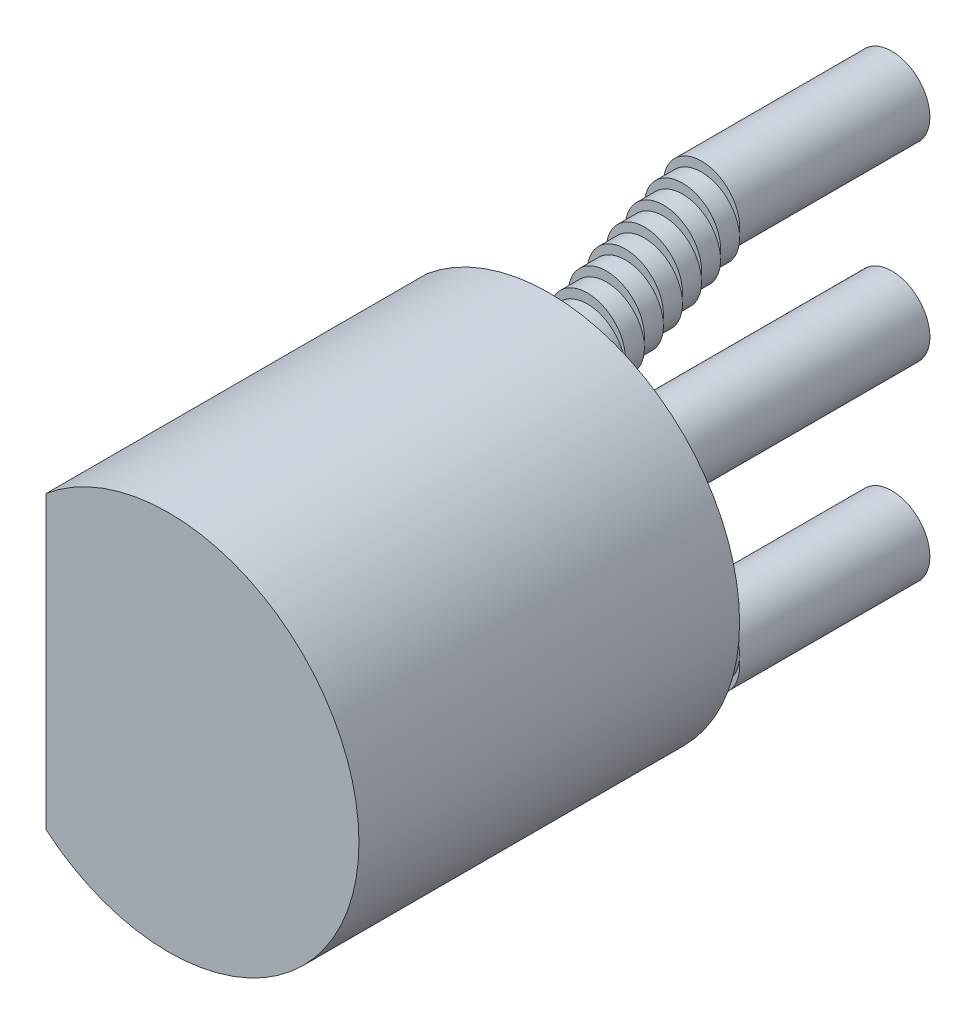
ISO-10303-21;
HEADER;
FILE_DESCRIPTION(('STEP AP214'),'2;1');
FILE_NAME('part.step','',(''),(''),'','','');
FILE_SCHEMA(('AUTOMOTIVE_DESIGN { 1 0 10303 214 1 1 1 1 }'));
ENDSEC;
DATA;
#1=APPLICATION_CONTEXT('core data for automotive mechanical design processes');
#2=APPLICATION_PROTOCOL_DEFINITION('international standard','automotive_design',2000,#1);
#3=PRODUCT_CONTEXT('',#1,'mechanical');
#4=PRODUCT('Part','Part','',(#3));
#5=PRODUCT_RELATED_PRODUCT_CATEGORY('part','',(#4));
#6=PRODUCT_DEFINITION_FORMATION('','',#4);
#7=PRODUCT_DEFINITION_CONTEXT('part definition',#1,'design');
#8=PRODUCT_DEFINITION('design','',#6,#7);
#9=PRODUCT_DEFINITION_SHAPE('','',#8);
#10=(LENGTH_UNIT() NAMED_UNIT(*) SI_UNIT(.MILLI.,.METRE.));
#11=(NAMED_UNIT(*) PLANE_ANGLE_UNIT() SI_UNIT($,.RADIAN.));
#12=(NAMED_UNIT(*) SI_UNIT($,.STERADIAN.) SOLID_ANGLE_UNIT());
#13=UNCERTAINTY_MEASURE_WITH_UNIT(LENGTH_MEASURE(1.E-05),#10,'distance_accuracy_value','');
#14=(GEOMETRIC_REPRESENTATION_CONTEXT(3) GLOBAL_UNCERTAINTY_ASSIGNED_CONTEXT((#13)) GLOBAL_UNIT_ASSIGNED_CONTEXT((#10,
#11,#12)) REPRESENTATION_CONTEXT('',''));
#15=CARTESIAN_POINT('',(0.,0.,0.));
#16=DIRECTION('',(0.,0.,1.));
#17=DIRECTION('',(1.,0.,0.));
#18=AXIS2_PLACEMENT_3D('',#15,#16,#17);
#19=CARTESIAN_POINT('',(0.,0.,0.));
#20=DIRECTION('',(0.,0.,-1.));
#21=DIRECTION('',(-1.,0.,0.));
#22=AXIS2_PLACEMENT_3D('',#19,#20,#21);
#23=PLANE('',#22);
#24=CARTESIAN_POINT('',(0.,1.524,0.));
#25=DIRECTION('',(0.,0.,-1.));
#26=DIRECTION('',(-1.,0.,0.));
#27=AXIS2_PLACEMENT_3D('',#24,#25,#26);
#28=CIRCLE('',#27,0.508);
#29=CARTESIAN_POINT('',(-0.508,1.524,0.));
#30=VERTEX_POINT('',#29);
#31=EDGE_CURVE('E294',#30,#30,#28,.T.);
#32=ORIENTED_EDGE('',*,*,#31,.F.);
#33=EDGE_LOOP('',(#32));
#34=FACE_BOUND('',#33,.T.);
#35=CARTESIAN_POINT('',(0.,0.,0.));
#36=DIRECTION('',(0.,0.,1.));
#37=DIRECTION('',(-1.,0.,0.));
#38=AXIS2_PLACEMENT_3D('',#35,#36,#37);
#39=CIRCLE('',#38,2.54);
#40=CARTESIAN_POINT('',(-1.63544965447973,-1.94342595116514,0.));
#41=VERTEX_POINT('',#40);
#42=CARTESIAN_POINT('',(-1.63544965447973,1.94342595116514,0.));
#43=VERTEX_POINT('',#42);
#44=EDGE_CURVE('E308',#41,#43,#39,.T.);
#45=ORIENTED_EDGE('',*,*,#44,.F.);
#46=DIRECTION('',(0.,-1.,0.));
#47=VECTOR('',#46,1.);
#48=CARTESIAN_POINT('',(-1.63544965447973,1.94342595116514,0.));
#49=LINE('',#48,#47);
#50=EDGE_CURVE('E315',#43,#41,#49,.T.);
#51=ORIENTED_EDGE('',*,*,#50,.F.);
#52=EDGE_LOOP('',(#45,#51));
#53=FACE_BOUND('',#52,.T.);
#54=CARTESIAN_POINT('',(0.,0.,0.));
#55=DIRECTION('',(0.,0.,-1.));
#56=DIRECTION('',(-1.,0.,0.));
#57=AXIS2_PLACEMENT_3D('',#54,#55,#56);
#58=CIRCLE('',#57,0.508);
#59=CARTESIAN_POINT('',(-0.508,0.,0.));
#60=VERTEX_POINT('',#59);
#61=EDGE_CURVE('E301',#60,#60,#58,.T.);
#62=ORIENTED_EDGE('',*,*,#61,.F.);
#63=EDGE_LOOP('',(#62));
#64=FACE_BOUND('',#63,.T.);
#65=CARTESIAN_POINT('',(0.,-1.524,0.));
#66=DIRECTION('',(0.,0.,-1.));
#67=DIRECTION('',(-1.,0.,0.));
#68=AXIS2_PLACEMENT_3D('',#65,#66,#67);
#69=CIRCLE('',#68,0.508);
#70=CARTESIAN_POINT('',(-0.508,-1.524,0.));
#71=VERTEX_POINT('',#70);
#72=EDGE_CURVE('E286',#71,#71,#69,.T.);
#73=ORIENTED_EDGE('',*,*,#72,.F.);
#74=EDGE_LOOP('',(#73));
#75=FACE_BOUND('',#74,.T.);
#76=ADVANCED_FACE('F33',(#34,#53,#64,#75),#23,.T.);
#77=CARTESIAN_POINT('',(0.,0.,5.08));
#78=DIRECTION('',(0.,0.,-1.));
#79=DIRECTION('',(-1.,0.,0.));
#80=AXIS2_PLACEMENT_3D('',#77,#78,#79);
#81=CYLINDRICAL_SURFACE('',#80,2.54);
#82=ORIENTED_EDGE('',*,*,#44,.T.);
#83=DIRECTION('',(0.,0.,-1.));
#84=VECTOR('',#83,1.);
#85=CARTESIAN_POINT('',(-1.63544965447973,1.94342595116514,5.08));
#86=LINE('',#85,#84);
#87=CARTESIAN_POINT('',(-1.63544965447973,1.94342595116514,5.08));
#88=VERTEX_POINT('',#87);
#89=EDGE_CURVE('E11',#88,#43,#86,.T.);
#90=ORIENTED_EDGE('',*,*,#89,.F.);
#91=CARTESIAN_POINT('',(0.,0.,5.08));
#92=DIRECTION('',(0.,0.,1.));
#93=DIRECTION('',(-1.,0.,0.));
#94=AXIS2_PLACEMENT_3D('',#91,#92,#93);
#95=CIRCLE('',#94,2.54);
#96=CARTESIAN_POINT('',(-1.63544965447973,-1.94342595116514,5.08));
#97=VERTEX_POINT('',#96);
#98=EDGE_CURVE('E311',#97,#88,#95,.T.);
#99=ORIENTED_EDGE('',*,*,#98,.F.);
#100=DIRECTION('',(0.,0.,-1.));
#101=VECTOR('',#100,1.);
#102=CARTESIAN_POINT('',(-1.63544965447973,-1.94342595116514,5.08));
#103=LINE('',#102,#101);
#104=EDGE_CURVE('E41',#97,#41,#103,.T.);
#105=ORIENTED_EDGE('',*,*,#104,.T.);
#106=EDGE_LOOP('',(#82,#90,#99,#105));
#107=FACE_BOUND('',#106,.T.);
#108=ADVANCED_FACE('F35',(#107),#81,.T.);
#109=CARTESIAN_POINT('',(-1.63544965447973,1.94342595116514,5.08));
#110=DIRECTION('',(1.,0.,0.));
#111=DIRECTION('',(0.,0.,-1.));
#112=AXIS2_PLACEMENT_3D('',#109,#110,#111);
#113=PLANE('',#112);
#114=ORIENTED_EDGE('',*,*,#50,.T.);
#115=ORIENTED_EDGE('',*,*,#104,.F.);
#116=DIRECTION('',(0.,-1.,0.));
#117=VECTOR('',#116,1.);
#118=CARTESIAN_POINT('',(-1.63544965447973,1.94342595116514,5.08));
#119=LINE('',#118,#117);
#120=EDGE_CURVE('E314',#88,#97,#119,.T.);
#121=ORIENTED_EDGE('',*,*,#120,.F.);
#122=ORIENTED_EDGE('',*,*,#89,.T.);
#123=EDGE_LOOP('',(#114,#115,#121,#122));
#124=FACE_BOUND('',#123,.T.);
#125=ADVANCED_FACE('F328',(#124),#113,.F.);
#126=CARTESIAN_POINT('',(0.,0.,5.08));
#127=DIRECTION('',(0.,0.,-1.));
#128=DIRECTION('',(-1.,0.,0.));
#129=AXIS2_PLACEMENT_3D('',#126,#127,#128);
#130=PLANE('',#129);
#131=ORIENTED_EDGE('',*,*,#98,.T.);
#132=ORIENTED_EDGE('',*,*,#120,.T.);
#133=EDGE_LOOP('',(#131,#132));
#134=FACE_BOUND('',#133,.T.);
#135=ADVANCED_FACE('F330',(#134),#130,.F.);
#136=CARTESIAN_POINT('',(0.,0.,-4.572));
#137=DIRECTION('',(0.,0.,1.));
#138=DIRECTION('',(1.,0.,0.));
#139=AXIS2_PLACEMENT_3D('',#136,#137,#138);
#140=CYLINDRICAL_SURFACE('',#139,0.508);
#141=CARTESIAN_POINT('',(0.,0.,-4.572));
#142=DIRECTION('',(0.,0.,-1.));
#143=DIRECTION('',(-1.,0.,0.));
#144=AXIS2_PLACEMENT_3D('',#141,#142,#143);
#145=CIRCLE('',#144,0.508);
#146=CARTESIAN_POINT('',(-0.508,0.,-4.572));
#147=VERTEX_POINT('',#146);
#148=EDGE_CURVE('E305',#147,#147,#145,.T.);
#149=ORIENTED_EDGE('',*,*,#148,.F.);
#150=EDGE_LOOP('',(#149));
#151=FACE_BOUND('',#150,.T.);
#152=ORIENTED_EDGE('',*,*,#61,.T.);
#153=EDGE_LOOP('',(#152));
#154=FACE_BOUND('',#153,.T.);
#155=ADVANCED_FACE('F332',(#151,#154),#140,.T.);
#156=CARTESIAN_POINT('',(0.,0.,-4.572));
#157=DIRECTION('',(0.,0.,-1.));
#158=DIRECTION('',(-1.,0.,0.));
#159=AXIS2_PLACEMENT_3D('',#156,#157,#158);
#160=PLANE('',#159);
#161=ORIENTED_EDGE('',*,*,#148,.T.);
#162=EDGE_LOOP('',(#161));
#163=FACE_BOUND('',#162,.T.);
#164=ADVANCED_FACE('F338',(#163),#160,.T.);
#165=CARTESIAN_POINT('',(0.,1.524,-0.254));
#166=DIRECTION('',(0.,0.,1.));
#167=DIRECTION('',(1.,0.,0.));
#168=AXIS2_PLACEMENT_3D('',#165,#166,#167);
#169=CYLINDRICAL_SURFACE('',#168,0.508);
#170=CARTESIAN_POINT('',(0.,1.524,-0.254));
#171=DIRECTION('',(0.,0.,-1.));
#172=DIRECTION('',(-1.,0.,0.));
#173=AXIS2_PLACEMENT_3D('',#170,#171,#172);
#174=CIRCLE('',#173,0.508);
#175=CARTESIAN_POINT('',(-0.504015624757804,1.5875,-0.254));
#176=VERTEX_POINT('',#175);
#177=CARTESIAN_POINT('',(0.504015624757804,1.5875,-0.254));
#178=VERTEX_POINT('',#177);
#179=EDGE_CURVE('E298',#176,#178,#174,.T.);
#180=ORIENTED_EDGE('',*,*,#179,.F.);
#181=EDGE_CURVE('E302',#178,#176,#174,.T.);
#182=ORIENTED_EDGE('',*,*,#181,.F.);
#183=EDGE_LOOP('',(#180,#182));
#184=FACE_BOUND('',#183,.T.);
#185=ORIENTED_EDGE('',*,*,#31,.T.);
#186=EDGE_LOOP('',(#185));
#187=FACE_BOUND('',#186,.T.);
#188=ADVANCED_FACE('F349',(#184,#187),#169,.T.);
#189=CARTESIAN_POINT('',(0.,1.524,-0.254));
#190=DIRECTION('',(0.,0.,-1.));
#191=DIRECTION('',(-1.,0.,0.));
#192=AXIS2_PLACEMENT_3D('',#189,#190,#191);
#193=PLANE('',#192);
#194=CARTESIAN_POINT('',(0.,1.651,-0.254));
#195=DIRECTION('',(0.,0.,-1.));
#196=DIRECTION('',(-1.,0.,0.));
#197=AXIS2_PLACEMENT_3D('',#194,#195,#196);
#198=CIRCLE('',#197,0.508);
#199=EDGE_CURVE('E288',#178,#176,#198,.T.);
#200=ORIENTED_EDGE('',*,*,#199,.F.);
#201=ORIENTED_EDGE('',*,*,#181,.T.);
#202=EDGE_LOOP('',(#200,#201));
#203=FACE_BOUND('',#202,.T.);
#204=ADVANCED_FACE('F351',(#203),#193,.T.);
#205=CARTESIAN_POINT('',(0.,-1.524,-0.254));
#206=DIRECTION('',(0.,0.,1.));
#207=DIRECTION('',(1.,0.,0.));
#208=AXIS2_PLACEMENT_3D('',#205,#206,#207);
#209=CYLINDRICAL_SURFACE('',#208,0.508);
#210=CARTESIAN_POINT('',(0.,-1.524,-0.254));
#211=DIRECTION('',(0.,0.,-1.));
#212=DIRECTION('',(-1.,0.,0.));
#213=AXIS2_PLACEMENT_3D('',#210,#211,#212);
#214=CIRCLE('',#213,0.508);
#215=CARTESIAN_POINT('',(0.504015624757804,-1.5875,-0.254));
#216=VERTEX_POINT('',#215);
#217=CARTESIAN_POINT('',(-0.504015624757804,-1.5875,-0.254));
#218=VERTEX_POINT('',#217);
#219=EDGE_CURVE('E291',#216,#218,#214,.T.);
#220=ORIENTED_EDGE('',*,*,#219,.F.);
#221=EDGE_CURVE('E295',#218,#216,#214,.T.);
#222=ORIENTED_EDGE('',*,*,#221,.F.);
#223=EDGE_LOOP('',(#220,#222));
#224=FACE_BOUND('',#223,.T.);
#225=ORIENTED_EDGE('',*,*,#72,.T.);
#226=EDGE_LOOP('',(#225));
#227=FACE_BOUND('',#226,.T.);
#228=ADVANCED_FACE('F358',(#224,#227),#209,.T.);
#229=CARTESIAN_POINT('',(0.,-1.524,-0.254));
#230=DIRECTION('',(0.,0.,-1.));
#231=DIRECTION('',(-1.,0.,0.));
#232=AXIS2_PLACEMENT_3D('',#229,#230,#231);
#233=PLANE('',#232);
#234=CARTESIAN_POINT('',(0.,-1.651,-0.254));
#235=DIRECTION('',(0.,0.,-1.));
#236=DIRECTION('',(-1.,0.,0.));
#237=AXIS2_PLACEMENT_3D('',#234,#235,#236);
#238=CIRCLE('',#237,0.508);
#239=EDGE_CURVE('E280',#218,#216,#238,.T.);
#240=ORIENTED_EDGE('',*,*,#239,.F.);
#241=ORIENTED_EDGE('',*,*,#221,.T.);
#242=EDGE_LOOP('',(#240,#241));
#243=FACE_BOUND('',#242,.T.);
#244=ADVANCED_FACE('F366',(#243),#233,.T.);
#245=CARTESIAN_POINT('',(0.,1.651,-0.254));
#246=DIRECTION('',(0.,0.,-1.));
#247=DIRECTION('',(-1.,0.,0.));
#248=AXIS2_PLACEMENT_3D('',#245,#246,#247);
#249=PLANE('',#248);
#250=EDGE_CURVE('E278',#176,#178,#198,.T.);
#251=ORIENTED_EDGE('',*,*,#250,.F.);
#252=ORIENTED_EDGE('',*,*,#179,.T.);
#253=EDGE_LOOP('',(#251,#252));
#254=FACE_BOUND('',#253,.T.);
#255=ADVANCED_FACE('F370',(#254),#249,.F.);
#256=CARTESIAN_POINT('',(0.,1.651,-0.508));
#257=DIRECTION('',(0.,0.,1.));
#258=DIRECTION('',(1.,0.,0.));
#259=AXIS2_PLACEMENT_3D('',#256,#257,#258);
#260=CYLINDRICAL_SURFACE('',#259,0.508);
#261=CARTESIAN_POINT('',(0.,1.651,-0.508));
#262=DIRECTION('',(0.,0.,-1.));
#263=DIRECTION('',(-1.,0.,0.));
#264=AXIS2_PLACEMENT_3D('',#261,#262,#263);
#265=CIRCLE('',#264,0.508);
#266=CARTESIAN_POINT('',(-0.504015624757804,1.7145,-0.508));
#267=VERTEX_POINT('',#266);
#268=CARTESIAN_POINT('',(0.504015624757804,1.7145,-0.508));
#269=VERTEX_POINT('',#268);
#270=EDGE_CURVE('E283',#267,#269,#265,.T.);
#271=ORIENTED_EDGE('',*,*,#270,.F.);
#272=EDGE_CURVE('E287',#269,#267,#265,.T.);
#273=ORIENTED_EDGE('',*,*,#272,.F.);
#274=EDGE_LOOP('',(#271,#273));
#275=FACE_BOUND('',#274,.T.);
#276=ORIENTED_EDGE('',*,*,#199,.T.);
#277=ORIENTED_EDGE('',*,*,#250,.T.);
#278=EDGE_LOOP('',(#276,#277));
#279=FACE_BOUND('',#278,.T.);
#280=ADVANCED_FACE('F372',(#275,#279),#260,.T.);
#281=CARTESIAN_POINT('',(0.,1.651,-0.508));
#282=DIRECTION('',(0.,0.,-1.));
#283=DIRECTION('',(-1.,0.,0.));
#284=AXIS2_PLACEMENT_3D('',#281,#282,#283);
#285=PLANE('',#284);
#286=CARTESIAN_POINT('',(0.,1.778,-0.508));
#287=DIRECTION('',(0.,0.,-1.));
#288=DIRECTION('',(-1.,0.,0.));
#289=AXIS2_PLACEMENT_3D('',#286,#287,#288);
#290=CIRCLE('',#289,0.508);
#291=EDGE_CURVE('E272',#269,#267,#290,.T.);
#292=ORIENTED_EDGE('',*,*,#291,.F.);
#293=ORIENTED_EDGE('',*,*,#272,.T.);
#294=EDGE_LOOP('',(#292,#293));
#295=FACE_BOUND('',#294,.T.);
#296=ADVANCED_FACE('F375',(#295),#285,.T.);
#297=CARTESIAN_POINT('',(0.,-1.651,-0.254));
#298=DIRECTION('',(0.,0.,-1.));
#299=DIRECTION('',(-1.,0.,0.));
#300=AXIS2_PLACEMENT_3D('',#297,#298,#299);
#301=PLANE('',#300);
#302=EDGE_CURVE('E270',#216,#218,#238,.T.);
#303=ORIENTED_EDGE('',*,*,#302,.F.);
#304=ORIENTED_EDGE('',*,*,#219,.T.);
#305=EDGE_LOOP('',(#303,#304));
#306=FACE_BOUND('',#305,.T.);
#307=ADVANCED_FACE('F382',(#306),#301,.F.);
#308=CARTESIAN_POINT('',(0.,-1.651,-0.508));
#309=DIRECTION('',(0.,0.,1.));
#310=DIRECTION('',(1.,0.,0.));
#311=AXIS2_PLACEMENT_3D('',#308,#309,#310);
#312=CYLINDRICAL_SURFACE('',#311,0.508);
#313=CARTESIAN_POINT('',(0.,-1.651,-0.508));
#314=DIRECTION('',(0.,0.,-1.));
#315=DIRECTION('',(-1.,0.,0.));
#316=AXIS2_PLACEMENT_3D('',#313,#314,#315);
#317=CIRCLE('',#316,0.508);
#318=CARTESIAN_POINT('',(0.504015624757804,-1.7145,-0.508));
#319=VERTEX_POINT('',#318);
#320=CARTESIAN_POINT('',(-0.504015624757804,-1.7145,-0.508));
#321=VERTEX_POINT('',#320);
#322=EDGE_CURVE('E275',#319,#321,#317,.T.);
#323=ORIENTED_EDGE('',*,*,#322,.F.);
#324=EDGE_CURVE('E279',#321,#319,#317,.T.);
#325=ORIENTED_EDGE('',*,*,#324,.F.);
#326=EDGE_LOOP('',(#323,#325));
#327=FACE_BOUND('',#326,.T.);
#328=ORIENTED_EDGE('',*,*,#239,.T.);
#329=ORIENTED_EDGE('',*,*,#302,.T.);
#330=EDGE_LOOP('',(#328,#329));
#331=FACE_BOUND('',#330,.T.);
#332=ADVANCED_FACE('F384',(#327,#331),#312,.T.);
#333=CARTESIAN_POINT('',(0.,-1.651,-0.508));
#334=DIRECTION('',(0.,0.,-1.));
#335=DIRECTION('',(-1.,0.,0.));
#336=AXIS2_PLACEMENT_3D('',#333,#334,#335);
#337=PLANE('',#336);
#338=CARTESIAN_POINT('',(0.,-1.778,-0.508));
#339=DIRECTION('',(0.,0.,-1.));
#340=DIRECTION('',(-1.,0.,0.));
#341=AXIS2_PLACEMENT_3D('',#338,#339,#340);
#342=CIRCLE('',#341,0.508);
#343=EDGE_CURVE('E264',#321,#319,#342,.T.);
#344=ORIENTED_EDGE('',*,*,#343,.F.);
#345=ORIENTED_EDGE('',*,*,#324,.T.);
#346=EDGE_LOOP('',(#344,#345));
#347=FACE_BOUND('',#346,.T.);
#348=ADVANCED_FACE('F387',(#347),#337,.T.);
#349=CARTESIAN_POINT('',(0.,1.778,-0.508));
#350=DIRECTION('',(0.,0.,-1.));
#351=DIRECTION('',(-1.,0.,0.));
#352=AXIS2_PLACEMENT_3D('',#349,#350,#351);
#353=PLANE('',#352);
#354=EDGE_CURVE('E262',#267,#269,#290,.T.);
#355=ORIENTED_EDGE('',*,*,#354,.F.);
#356=ORIENTED_EDGE('',*,*,#270,.T.);
#357=EDGE_LOOP('',(#355,#356));
#358=FACE_BOUND('',#357,.T.);
#359=ADVANCED_FACE('F394',(#358),#353,.F.);
#360=CARTESIAN_POINT('',(0.,1.778,-0.762));
#361=DIRECTION('',(0.,0.,1.));
#362=DIRECTION('',(1.,0.,0.));
#363=AXIS2_PLACEMENT_3D('',#360,#361,#362);
#364=CYLINDRICAL_SURFACE('',#363,0.508);
#365=CARTESIAN_POINT('',(0.,1.778,-0.762));
#366=DIRECTION('',(0.,0.,-1.));
#367=DIRECTION('',(-1.,0.,0.));
#368=AXIS2_PLACEMENT_3D('',#365,#366,#367);
#369=CIRCLE('',#368,0.508);
#370=CARTESIAN_POINT('',(-0.504015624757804,1.8415,-0.762));
#371=VERTEX_POINT('',#370);
#372=CARTESIAN_POINT('',(0.504015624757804,1.8415,-0.762));
#373=VERTEX_POINT('',#372);
#374=EDGE_CURVE('E267',#371,#373,#369,.T.);
#375=ORIENTED_EDGE('',*,*,#374,.F.);
#376=EDGE_CURVE('E271',#373,#371,#369,.T.);
#377=ORIENTED_EDGE('',*,*,#376,.F.);
#378=EDGE_LOOP('',(#375,#377));
#379=FACE_BOUND('',#378,.T.);
#380=ORIENTED_EDGE('',*,*,#291,.T.);
#381=ORIENTED_EDGE('',*,*,#354,.T.);
#382=EDGE_LOOP('',(#380,#381));
#383=FACE_BOUND('',#382,.T.);
#384=ADVANCED_FACE('F396',(#379,#383),#364,.T.);
#385=CARTESIAN_POINT('',(0.,1.778,-0.762));
#386=DIRECTION('',(0.,0.,-1.));
#387=DIRECTION('',(-1.,0.,0.));
#388=AXIS2_PLACEMENT_3D('',#385,#386,#387);
#389=PLANE('',#388);
#390=CARTESIAN_POINT('',(0.,1.905,-0.762));
#391=DIRECTION('',(0.,0.,-1.));
#392=DIRECTION('',(-1.,0.,0.));
#393=AXIS2_PLACEMENT_3D('',#390,#391,#392);
#394=CIRCLE('',#393,0.508);
#395=EDGE_CURVE('E256',#373,#371,#394,.T.);
#396=ORIENTED_EDGE('',*,*,#395,.F.);
#397=ORIENTED_EDGE('',*,*,#376,.T.);
#398=EDGE_LOOP('',(#396,#397));
#399=FACE_BOUND('',#398,.T.);
#400=ADVANCED_FACE('F399',(#399),#389,.T.);
#401=CARTESIAN_POINT('',(0.,-1.778,-0.508));
#402=DIRECTION('',(0.,0.,-1.));
#403=DIRECTION('',(-1.,0.,0.));
#404=AXIS2_PLACEMENT_3D('',#401,#402,#403);
#405=PLANE('',#404);
#406=EDGE_CURVE('E254',#319,#321,#342,.T.);
#407=ORIENTED_EDGE('',*,*,#406,.F.);
#408=ORIENTED_EDGE('',*,*,#322,.T.);
#409=EDGE_LOOP('',(#407,#408));
#410=FACE_BOUND('',#409,.T.);
#411=ADVANCED_FACE('F406',(#410),#405,.F.);
#412=CARTESIAN_POINT('',(0.,-1.778,-0.762));
#413=DIRECTION('',(0.,0.,1.));
#414=DIRECTION('',(1.,0.,0.));
#415=AXIS2_PLACEMENT_3D('',#412,#413,#414);
#416=CYLINDRICAL_SURFACE('',#415,0.508);
#417=CARTESIAN_POINT('',(0.,-1.778,-0.762));
#418=DIRECTION('',(0.,0.,-1.));
#419=DIRECTION('',(-1.,0.,0.));
#420=AXIS2_PLACEMENT_3D('',#417,#418,#419);
#421=CIRCLE('',#420,0.508);
#422=CARTESIAN_POINT('',(0.504015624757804,-1.8415,-0.762));
#423=VERTEX_POINT('',#422);
#424=CARTESIAN_POINT('',(-0.504015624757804,-1.8415,-0.762));
#425=VERTEX_POINT('',#424);
#426=EDGE_CURVE('E259',#423,#425,#421,.T.);
#427=ORIENTED_EDGE('',*,*,#426,.F.);
#428=EDGE_CURVE('E263',#425,#423,#421,.T.);
#429=ORIENTED_EDGE('',*,*,#428,.F.);
#430=EDGE_LOOP('',(#427,#429));
#431=FACE_BOUND('',#430,.T.);
#432=ORIENTED_EDGE('',*,*,#343,.T.);
#433=ORIENTED_EDGE('',*,*,#406,.T.);
#434=EDGE_LOOP('',(#432,#433));
#435=FACE_BOUND('',#434,.T.);
#436=ADVANCED_FACE('F408',(#431,#435),#416,.T.);
#437=CARTESIAN_POINT('',(0.,-1.778,-0.762));
#438=DIRECTION('',(0.,0.,-1.));
#439=DIRECTION('',(-1.,0.,0.));
#440=AXIS2_PLACEMENT_3D('',#437,#438,#439);
#441=PLANE('',#440);
#442=CARTESIAN_POINT('',(0.,-1.905,-0.762));
#443=DIRECTION('',(0.,0.,-1.));
#444=DIRECTION('',(-1.,0.,0.));
#445=AXIS2_PLACEMENT_3D('',#442,#443,#444);
#446=CIRCLE('',#445,0.508);
#447=EDGE_CURVE('E248',#425,#423,#446,.T.);
#448=ORIENTED_EDGE('',*,*,#447,.F.);
#449=ORIENTED_EDGE('',*,*,#428,.T.);
#450=EDGE_LOOP('',(#448,#449));
#451=FACE_BOUND('',#450,.T.);
#452=ADVANCED_FACE('F411',(#451),#441,.T.);
#453=CARTESIAN_POINT('',(0.,1.905,-0.762));
#454=DIRECTION('',(0.,0.,-1.));
#455=DIRECTION('',(-1.,0.,0.));
#456=AXIS2_PLACEMENT_3D('',#453,#454,#455);
#457=PLANE('',#456);
#458=EDGE_CURVE('E246',#371,#373,#394,.T.);
#459=ORIENTED_EDGE('',*,*,#458,.F.);
#460=ORIENTED_EDGE('',*,*,#374,.T.);
#461=EDGE_LOOP('',(#459,#460));
#462=FACE_BOUND('',#461,.T.);
#463=ADVANCED_FACE('F418',(#462),#457,.F.);
#464=CARTESIAN_POINT('',(0.,1.905,-1.016));
#465=DIRECTION('',(0.,0.,1.));
#466=DIRECTION('',(1.,0.,0.));
#467=AXIS2_PLACEMENT_3D('',#464,#465,#466);
#468=CYLINDRICAL_SURFACE('',#467,0.508);
#469=CARTESIAN_POINT('',(0.,1.905,-1.016));
#470=DIRECTION('',(0.,0.,-1.));
#471=DIRECTION('',(-1.,0.,0.));
#472=AXIS2_PLACEMENT_3D('',#469,#470,#471);
#473=CIRCLE('',#472,0.508);
#474=CARTESIAN_POINT('',(-0.504015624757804,1.9685,-1.016));
#475=VERTEX_POINT('',#474);
#476=CARTESIAN_POINT('',(0.504015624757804,1.9685,-1.016));
#477=VERTEX_POINT('',#476);
#478=EDGE_CURVE('E251',#475,#477,#473,.T.);
#479=ORIENTED_EDGE('',*,*,#478,.F.);
#480=EDGE_CURVE('E255',#477,#475,#473,.T.);
#481=ORIENTED_EDGE('',*,*,#480,.F.);
#482=EDGE_LOOP('',(#479,#481));
#483=FACE_BOUND('',#482,.T.);
#484=ORIENTED_EDGE('',*,*,#395,.T.);
#485=ORIENTED_EDGE('',*,*,#458,.T.);
#486=EDGE_LOOP('',(#484,#485));
#487=FACE_BOUND('',#486,.T.);
#488=ADVANCED_FACE('F420',(#483,#487),#468,.T.);
#489=CARTESIAN_POINT('',(0.,1.905,-1.016));
#490=DIRECTION('',(0.,0.,-1.));
#491=DIRECTION('',(-1.,0.,0.));
#492=AXIS2_PLACEMENT_3D('',#489,#490,#491);
#493=PLANE('',#492);
#494=CARTESIAN_POINT('',(0.,2.032,-1.016));
#495=DIRECTION('',(0.,0.,-1.));
#496=DIRECTION('',(-1.,0.,0.));
#497=AXIS2_PLACEMENT_3D('',#494,#495,#496);
#498=CIRCLE('',#497,0.508);
#499=EDGE_CURVE('E240',#477,#475,#498,.T.);
#500=ORIENTED_EDGE('',*,*,#499,.F.);
#501=ORIENTED_EDGE('',*,*,#480,.T.);
#502=EDGE_LOOP('',(#500,#501));
#503=FACE_BOUND('',#502,.T.);
#504=ADVANCED_FACE('F423',(#503),#493,.T.);
#505=CARTESIAN_POINT('',(0.,-1.905,-0.762));
#506=DIRECTION('',(0.,0.,-1.));
#507=DIRECTION('',(-1.,0.,0.));
#508=AXIS2_PLACEMENT_3D('',#505,#506,#507);
#509=PLANE('',#508);
#510=EDGE_CURVE('E238',#423,#425,#446,.T.);
#511=ORIENTED_EDGE('',*,*,#510,.F.);
#512=ORIENTED_EDGE('',*,*,#426,.T.);
#513=EDGE_LOOP('',(#511,#512));
#514=FACE_BOUND('',#513,.T.);
#515=ADVANCED_FACE('F430',(#514),#509,.F.);
#516=CARTESIAN_POINT('',(0.,-1.905,-1.016));
#517=DIRECTION('',(0.,0.,1.));
#518=DIRECTION('',(1.,0.,0.));
#519=AXIS2_PLACEMENT_3D('',#516,#517,#518);
#520=CYLINDRICAL_SURFACE('',#519,0.508);
#521=CARTESIAN_POINT('',(0.,-1.905,-1.016));
#522=DIRECTION('',(0.,0.,-1.));
#523=DIRECTION('',(-1.,0.,0.));
#524=AXIS2_PLACEMENT_3D('',#521,#522,#523);
#525=CIRCLE('',#524,0.508);
#526=CARTESIAN_POINT('',(0.504015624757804,-1.9685,-1.016));
#527=VERTEX_POINT('',#526);
#528=CARTESIAN_POINT('',(-0.504015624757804,-1.9685,-1.016));
#529=VERTEX_POINT('',#528);
#530=EDGE_CURVE('E243',#527,#529,#525,.T.);
#531=ORIENTED_EDGE('',*,*,#530,.F.);
#532=EDGE_CURVE('E247',#529,#527,#525,.T.);
#533=ORIENTED_EDGE('',*,*,#532,.F.);
#534=EDGE_LOOP('',(#531,#533));
#535=FACE_BOUND('',#534,.T.);
#536=ORIENTED_EDGE('',*,*,#447,.T.);
#537=ORIENTED_EDGE('',*,*,#510,.T.);
#538=EDGE_LOOP('',(#536,#537));
#539=FACE_BOUND('',#538,.T.);
#540=ADVANCED_FACE('F432',(#535,#539),#520,.T.);
#541=CARTESIAN_POINT('',(0.,-1.905,-1.016));
#542=DIRECTION('',(0.,0.,-1.));
#543=DIRECTION('',(-1.,0.,0.));
#544=AXIS2_PLACEMENT_3D('',#541,#542,#543);
#545=PLANE('',#544);
#546=CARTESIAN_POINT('',(0.,-2.032,-1.016));
#547=DIRECTION('',(0.,0.,-1.));
#548=DIRECTION('',(-1.,0.,0.));
#549=AXIS2_PLACEMENT_3D('',#546,#547,#548);
#550=CIRCLE('',#549,0.508);
#551=EDGE_CURVE('E232',#529,#527,#550,.T.);
#552=ORIENTED_EDGE('',*,*,#551,.F.);
#553=ORIENTED_EDGE('',*,*,#532,.T.);
#554=EDGE_LOOP('',(#552,#553));
#555=FACE_BOUND('',#554,.T.);
#556=ADVANCED_FACE('F435',(#555),#545,.T.);
#557=CARTESIAN_POINT('',(0.,2.032,-1.016));
#558=DIRECTION('',(0.,0.,-1.));
#559=DIRECTION('',(-1.,0.,0.));
#560=AXIS2_PLACEMENT_3D('',#557,#558,#559);
#561=PLANE('',#560);
#562=EDGE_CURVE('E230',#475,#477,#498,.T.);
#563=ORIENTED_EDGE('',*,*,#562,.F.);
#564=ORIENTED_EDGE('',*,*,#478,.T.);
#565=EDGE_LOOP('',(#563,#564));
#566=FACE_BOUND('',#565,.T.);
#567=ADVANCED_FACE('F442',(#566),#561,.F.);
#568=CARTESIAN_POINT('',(0.,2.032,-1.27));
#569=DIRECTION('',(0.,0.,1.));
#570=DIRECTION('',(1.,0.,0.));
#571=AXIS2_PLACEMENT_3D('',#568,#569,#570);
#572=CYLINDRICAL_SURFACE('',#571,0.508);
#573=CARTESIAN_POINT('',(0.,2.032,-1.27));
#574=DIRECTION('',(0.,0.,-1.));
#575=DIRECTION('',(-1.,0.,0.));
#576=AXIS2_PLACEMENT_3D('',#573,#574,#575);
#577=CIRCLE('',#576,0.508);
#578=CARTESIAN_POINT('',(-0.504015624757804,2.0955,-1.27));
#579=VERTEX_POINT('',#578);
#580=CARTESIAN_POINT('',(0.504015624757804,2.0955,-1.27));
#581=VERTEX_POINT('',#580);
#582=EDGE_CURVE('E235',#579,#581,#577,.T.);
#583=ORIENTED_EDGE('',*,*,#582,.F.);
#584=EDGE_CURVE('E239',#581,#579,#577,.T.);
#585=ORIENTED_EDGE('',*,*,#584,.F.);
#586=EDGE_LOOP('',(#583,#585));
#587=FACE_BOUND('',#586,.T.);
#588=ORIENTED_EDGE('',*,*,#499,.T.);
#589=ORIENTED_EDGE('',*,*,#562,.T.);
#590=EDGE_LOOP('',(#588,#589));
#591=FACE_BOUND('',#590,.T.);
#592=ADVANCED_FACE('F444',(#587,#591),#572,.T.);
#593=CARTESIAN_POINT('',(0.,2.032,-1.27));
#594=DIRECTION('',(0.,0.,-1.));
#595=DIRECTION('',(-1.,0.,0.));
#596=AXIS2_PLACEMENT_3D('',#593,#594,#595);
#597=PLANE('',#596);
#598=CARTESIAN_POINT('',(0.,2.159,-1.27));
#599=DIRECTION('',(0.,0.,-1.));
#600=DIRECTION('',(-1.,0.,0.));
#601=AXIS2_PLACEMENT_3D('',#598,#599,#600);
#602=CIRCLE('',#601,0.508);
#603=EDGE_CURVE('E224',#581,#579,#602,.T.);
#604=ORIENTED_EDGE('',*,*,#603,.F.);
#605=ORIENTED_EDGE('',*,*,#584,.T.);
#606=EDGE_LOOP('',(#604,#605));
#607=FACE_BOUND('',#606,.T.);
#608=ADVANCED_FACE('F447',(#607),#597,.T.);
#609=CARTESIAN_POINT('',(0.,-2.032,-1.016));
#610=DIRECTION('',(0.,0.,-1.));
#611=DIRECTION('',(-1.,0.,0.));
#612=AXIS2_PLACEMENT_3D('',#609,#610,#611);
#613=PLANE('',#612);
#614=EDGE_CURVE('E222',#527,#529,#550,.T.);
#615=ORIENTED_EDGE('',*,*,#614,.F.);
#616=ORIENTED_EDGE('',*,*,#530,.T.);
#617=EDGE_LOOP('',(#615,#616));
#618=FACE_BOUND('',#617,.T.);
#619=ADVANCED_FACE('F454',(#618),#613,.F.);
#620=CARTESIAN_POINT('',(0.,-2.032,-1.27));
#621=DIRECTION('',(0.,0.,1.));
#622=DIRECTION('',(1.,0.,0.));
#623=AXIS2_PLACEMENT_3D('',#620,#621,#622);
#624=CYLINDRICAL_SURFACE('',#623,0.508);
#625=CARTESIAN_POINT('',(0.,-2.032,-1.27));
#626=DIRECTION('',(0.,0.,-1.));
#627=DIRECTION('',(-1.,0.,0.));
#628=AXIS2_PLACEMENT_3D('',#625,#626,#627);
#629=CIRCLE('',#628,0.508);
#630=CARTESIAN_POINT('',(0.504015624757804,-2.0955,-1.27));
#631=VERTEX_POINT('',#630);
#632=CARTESIAN_POINT('',(-0.504015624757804,-2.0955,-1.27));
#633=VERTEX_POINT('',#632);
#634=EDGE_CURVE('E227',#631,#633,#629,.T.);
#635=ORIENTED_EDGE('',*,*,#634,.F.);
#636=EDGE_CURVE('E231',#633,#631,#629,.T.);
#637=ORIENTED_EDGE('',*,*,#636,.F.);
#638=EDGE_LOOP('',(#635,#637));
#639=FACE_BOUND('',#638,.T.);
#640=ORIENTED_EDGE('',*,*,#551,.T.);
#641=ORIENTED_EDGE('',*,*,#614,.T.);
#642=EDGE_LOOP('',(#640,#641));
#643=FACE_BOUND('',#642,.T.);
#644=ADVANCED_FACE('F456',(#639,#643),#624,.T.);
#645=CARTESIAN_POINT('',(0.,-2.032,-1.27));
#646=DIRECTION('',(0.,0.,-1.));
#647=DIRECTION('',(-1.,0.,0.));
#648=AXIS2_PLACEMENT_3D('',#645,#646,#647);
#649=PLANE('',#648);
#650=CARTESIAN_POINT('',(0.,-2.159,-1.27));
#651=DIRECTION('',(0.,0.,-1.));
#652=DIRECTION('',(-1.,0.,0.));
#653=AXIS2_PLACEMENT_3D('',#650,#651,#652);
#654=CIRCLE('',#653,0.508);
#655=EDGE_CURVE('E216',#633,#631,#654,.T.);
#656=ORIENTED_EDGE('',*,*,#655,.F.);
#657=ORIENTED_EDGE('',*,*,#636,.T.);
#658=EDGE_LOOP('',(#656,#657));
#659=FACE_BOUND('',#658,.T.);
#660=ADVANCED_FACE('F459',(#659),#649,.T.);
#661=CARTESIAN_POINT('',(0.,2.159,-1.27));
#662=DIRECTION('',(0.,0.,-1.));
#663=DIRECTION('',(-1.,0.,0.));
#664=AXIS2_PLACEMENT_3D('',#661,#662,#663);
#665=PLANE('',#664);
#666=EDGE_CURVE('E214',#579,#581,#602,.T.);
#667=ORIENTED_EDGE('',*,*,#666,.F.);
#668=ORIENTED_EDGE('',*,*,#582,.T.);
#669=EDGE_LOOP('',(#667,#668));
#670=FACE_BOUND('',#669,.T.);
#671=ADVANCED_FACE('F466',(#670),#665,.F.);
#672=CARTESIAN_POINT('',(0.,2.159,-1.524));
#673=DIRECTION('',(0.,0.,1.));
#674=DIRECTION('',(1.,0.,0.));
#675=AXIS2_PLACEMENT_3D('',#672,#673,#674);
#676=CYLINDRICAL_SURFACE('',#675,0.508);
#677=CARTESIAN_POINT('',(0.,2.159,-1.524));
#678=DIRECTION('',(0.,0.,-1.));
#679=DIRECTION('',(-1.,0.,0.));
#680=AXIS2_PLACEMENT_3D('',#677,#678,#679);
#681=CIRCLE('',#680,0.508);
#682=CARTESIAN_POINT('',(-0.504015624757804,2.2225,-1.524));
#683=VERTEX_POINT('',#682);
#684=CARTESIAN_POINT('',(0.504015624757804,2.2225,-1.524));
#685=VERTEX_POINT('',#684);
#686=EDGE_CURVE('E219',#683,#685,#681,.T.);
#687=ORIENTED_EDGE('',*,*,#686,.F.);
#688=EDGE_CURVE('E223',#685,#683,#681,.T.);
#689=ORIENTED_EDGE('',*,*,#688,.F.);
#690=EDGE_LOOP('',(#687,#689));
#691=FACE_BOUND('',#690,.T.);
#692=ORIENTED_EDGE('',*,*,#603,.T.);
#693=ORIENTED_EDGE('',*,*,#666,.T.);
#694=EDGE_LOOP('',(#692,#693));
#695=FACE_BOUND('',#694,.T.);
#696=ADVANCED_FACE('F468',(#691,#695),#676,.T.);
#697=CARTESIAN_POINT('',(0.,2.159,-1.524));
#698=DIRECTION('',(0.,0.,-1.));
#699=DIRECTION('',(-1.,0.,0.));
#700=AXIS2_PLACEMENT_3D('',#697,#698,#699);
#701=PLANE('',#700);
#702=CARTESIAN_POINT('',(0.,2.286,-1.524));
#703=DIRECTION('',(0.,0.,-1.));
#704=DIRECTION('',(-1.,0.,0.));
#705=AXIS2_PLACEMENT_3D('',#702,#703,#704);
#706=CIRCLE('',#705,0.508);
#707=EDGE_CURVE('E208',#685,#683,#706,.T.);
#708=ORIENTED_EDGE('',*,*,#707,.F.);
#709=ORIENTED_EDGE('',*,*,#688,.T.);
#710=EDGE_LOOP('',(#708,#709));
#711=FACE_BOUND('',#710,.T.);
#712=ADVANCED_FACE('F471',(#711),#701,.T.);
#713=CARTESIAN_POINT('',(0.,-2.159,-1.27));
#714=DIRECTION('',(0.,0.,-1.));
#715=DIRECTION('',(-1.,0.,0.));
#716=AXIS2_PLACEMENT_3D('',#713,#714,#715);
#717=PLANE('',#716);
#718=EDGE_CURVE('E206',#631,#633,#654,.T.);
#719=ORIENTED_EDGE('',*,*,#718,.F.);
#720=ORIENTED_EDGE('',*,*,#634,.T.);
#721=EDGE_LOOP('',(#719,#720));
#722=FACE_BOUND('',#721,.T.);
#723=ADVANCED_FACE('F478',(#722),#717,.F.);
#724=CARTESIAN_POINT('',(0.,-2.159,-1.524));
#725=DIRECTION('',(0.,0.,1.));
#726=DIRECTION('',(1.,0.,0.));
#727=AXIS2_PLACEMENT_3D('',#724,#725,#726);
#728=CYLINDRICAL_SURFACE('',#727,0.508);
#729=CARTESIAN_POINT('',(0.,-2.159,-1.524));
#730=DIRECTION('',(0.,0.,-1.));
#731=DIRECTION('',(-1.,0.,0.));
#732=AXIS2_PLACEMENT_3D('',#729,#730,#731);
#733=CIRCLE('',#732,0.508);
#734=CARTESIAN_POINT('',(0.504015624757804,-2.2225,-1.524));
#735=VERTEX_POINT('',#734);
#736=CARTESIAN_POINT('',(-0.504015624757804,-2.2225,-1.524));
#737=VERTEX_POINT('',#736);
#738=EDGE_CURVE('E211',#735,#737,#733,.T.);
#739=ORIENTED_EDGE('',*,*,#738,.F.);
#740=EDGE_CURVE('E215',#737,#735,#733,.T.);
#741=ORIENTED_EDGE('',*,*,#740,.F.);
#742=EDGE_LOOP('',(#739,#741));
#743=FACE_BOUND('',#742,.T.);
#744=ORIENTED_EDGE('',*,*,#655,.T.);
#745=ORIENTED_EDGE('',*,*,#718,.T.);
#746=EDGE_LOOP('',(#744,#745));
#747=FACE_BOUND('',#746,.T.);
#748=ADVANCED_FACE('F480',(#743,#747),#728,.T.);
#749=CARTESIAN_POINT('',(0.,-2.159,-1.524));
#750=DIRECTION('',(0.,0.,-1.));
#751=DIRECTION('',(-1.,0.,0.));
#752=AXIS2_PLACEMENT_3D('',#749,#750,#751);
#753=PLANE('',#752);
#754=CARTESIAN_POINT('',(0.,-2.286,-1.524));
#755=DIRECTION('',(0.,0.,-1.));
#756=DIRECTION('',(-1.,0.,0.));
#757=AXIS2_PLACEMENT_3D('',#754,#755,#756);
#758=CIRCLE('',#757,0.508);
#759=EDGE_CURVE('E200',#737,#735,#758,.T.);
#760=ORIENTED_EDGE('',*,*,#759,.F.);
#761=ORIENTED_EDGE('',*,*,#740,.T.);
#762=EDGE_LOOP('',(#760,#761));
#763=FACE_BOUND('',#762,.T.);
#764=ADVANCED_FACE('F483',(#763),#753,.T.);
#765=CARTESIAN_POINT('',(0.,2.286,-1.524));
#766=DIRECTION('',(0.,0.,-1.));
#767=DIRECTION('',(-1.,0.,0.));
#768=AXIS2_PLACEMENT_3D('',#765,#766,#767);
#769=PLANE('',#768);
#770=EDGE_CURVE('E198',#683,#685,#706,.T.);
#771=ORIENTED_EDGE('',*,*,#770,.F.);
#772=ORIENTED_EDGE('',*,*,#686,.T.);
#773=EDGE_LOOP('',(#771,#772));
#774=FACE_BOUND('',#773,.T.);
#775=ADVANCED_FACE('F490',(#774),#769,.F.);
#776=CARTESIAN_POINT('',(0.,2.286,-1.778));
#777=DIRECTION('',(0.,0.,1.));
#778=DIRECTION('',(1.,0.,0.));
#779=AXIS2_PLACEMENT_3D('',#776,#777,#778);
#780=CYLINDRICAL_SURFACE('',#779,0.508);
#781=CARTESIAN_POINT('',(0.,2.286,-1.778));
#782=DIRECTION('',(0.,0.,-1.));
#783=DIRECTION('',(-1.,0.,0.));
#784=AXIS2_PLACEMENT_3D('',#781,#782,#783);
#785=CIRCLE('',#784,0.508);
#786=CARTESIAN_POINT('',(-0.504015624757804,2.3495,-1.778));
#787=VERTEX_POINT('',#786);
#788=CARTESIAN_POINT('',(0.504015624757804,2.3495,-1.778));
#789=VERTEX_POINT('',#788);
#790=EDGE_CURVE('E203',#787,#789,#785,.T.);
#791=ORIENTED_EDGE('',*,*,#790,.F.);
#792=EDGE_CURVE('E207',#789,#787,#785,.T.);
#793=ORIENTED_EDGE('',*,*,#792,.F.);
#794=EDGE_LOOP('',(#791,#793));
#795=FACE_BOUND('',#794,.T.);
#796=ORIENTED_EDGE('',*,*,#707,.T.);
#797=ORIENTED_EDGE('',*,*,#770,.T.);
#798=EDGE_LOOP('',(#796,#797));
#799=FACE_BOUND('',#798,.T.);
#800=ADVANCED_FACE('F492',(#795,#799),#780,.T.);
#801=CARTESIAN_POINT('',(0.,2.286,-1.778));
#802=DIRECTION('',(0.,0.,-1.));
#803=DIRECTION('',(-1.,0.,0.));
#804=AXIS2_PLACEMENT_3D('',#801,#802,#803);
#805=PLANE('',#804);
#806=CARTESIAN_POINT('',(0.,2.413,-1.778));
#807=DIRECTION('',(0.,0.,-1.));
#808=DIRECTION('',(-1.,0.,0.));
#809=AXIS2_PLACEMENT_3D('',#806,#807,#808);
#810=CIRCLE('',#809,0.508);
#811=EDGE_CURVE('E192',#789,#787,#810,.T.);
#812=ORIENTED_EDGE('',*,*,#811,.F.);
#813=ORIENTED_EDGE('',*,*,#792,.T.);
#814=EDGE_LOOP('',(#812,#813));
#815=FACE_BOUND('',#814,.T.);
#816=ADVANCED_FACE('F495',(#815),#805,.T.);
#817=CARTESIAN_POINT('',(0.,-2.286,-1.524));
#818=DIRECTION('',(0.,0.,-1.));
#819=DIRECTION('',(-1.,0.,0.));
#820=AXIS2_PLACEMENT_3D('',#817,#818,#819);
#821=PLANE('',#820);
#822=EDGE_CURVE('E190',#735,#737,#758,.T.);
#823=ORIENTED_EDGE('',*,*,#822,.F.);
#824=ORIENTED_EDGE('',*,*,#738,.T.);
#825=EDGE_LOOP('',(#823,#824));
#826=FACE_BOUND('',#825,.T.);
#827=ADVANCED_FACE('F502',(#826),#821,.F.);
#828=CARTESIAN_POINT('',(0.,-2.286,-1.778));
#829=DIRECTION('',(0.,0.,1.));
#830=DIRECTION('',(1.,0.,0.));
#831=AXIS2_PLACEMENT_3D('',#828,#829,#830);
#832=CYLINDRICAL_SURFACE('',#831,0.508);
#833=CARTESIAN_POINT('',(0.,-2.286,-1.778));
#834=DIRECTION('',(0.,0.,-1.));
#835=DIRECTION('',(-1.,0.,0.));
#836=AXIS2_PLACEMENT_3D('',#833,#834,#835);
#837=CIRCLE('',#836,0.508);
#838=CARTESIAN_POINT('',(0.504015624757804,-2.3495,-1.778));
#839=VERTEX_POINT('',#838);
#840=CARTESIAN_POINT('',(-0.504015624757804,-2.3495,-1.778));
#841=VERTEX_POINT('',#840);
#842=EDGE_CURVE('E195',#839,#841,#837,.T.);
#843=ORIENTED_EDGE('',*,*,#842,.F.);
#844=EDGE_CURVE('E199',#841,#839,#837,.T.);
#845=ORIENTED_EDGE('',*,*,#844,.F.);
#846=EDGE_LOOP('',(#843,#845));
#847=FACE_BOUND('',#846,.T.);
#848=ORIENTED_EDGE('',*,*,#759,.T.);
#849=ORIENTED_EDGE('',*,*,#822,.T.);
#850=EDGE_LOOP('',(#848,#849));
#851=FACE_BOUND('',#850,.T.);
#852=ADVANCED_FACE('F504',(#847,#851),#832,.T.);
#853=CARTESIAN_POINT('',(0.,-2.286,-1.778));
#854=DIRECTION('',(0.,0.,-1.));
#855=DIRECTION('',(-1.,0.,0.));
#856=AXIS2_PLACEMENT_3D('',#853,#854,#855);
#857=PLANE('',#856);
#858=CARTESIAN_POINT('',(0.,-2.413,-1.778));
#859=DIRECTION('',(0.,0.,-1.));
#860=DIRECTION('',(-1.,0.,0.));
#861=AXIS2_PLACEMENT_3D('',#858,#859,#860);
#862=CIRCLE('',#861,0.508);
#863=EDGE_CURVE('E169',#841,#839,#862,.T.);
#864=ORIENTED_EDGE('',*,*,#863,.F.);
#865=ORIENTED_EDGE('',*,*,#844,.T.);
#866=EDGE_LOOP('',(#864,#865));
#867=FACE_BOUND('',#866,.T.);
#868=ADVANCED_FACE('F507',(#867),#857,.T.);
#869=CARTESIAN_POINT('',(0.,2.413,-1.778));
#870=DIRECTION('',(0.,0.,-1.));
#871=DIRECTION('',(-1.,0.,0.));
#872=AXIS2_PLACEMENT_3D('',#869,#870,#871);
#873=PLANE('',#872);
#874=EDGE_CURVE('E166',#787,#789,#810,.T.);
#875=ORIENTED_EDGE('',*,*,#874,.F.);
#876=ORIENTED_EDGE('',*,*,#790,.T.);
#877=EDGE_LOOP('',(#875,#876));
#878=FACE_BOUND('',#877,.T.);
#879=ADVANCED_FACE('F514',(#878),#873,.F.);
#880=CARTESIAN_POINT('',(0.,2.413,-2.032));
#881=DIRECTION('',(0.,0.,1.));
#882=DIRECTION('',(1.,0.,0.));
#883=AXIS2_PLACEMENT_3D('',#880,#881,#882);
#884=CYLINDRICAL_SURFACE('',#883,0.508);
#885=CARTESIAN_POINT('',(0.,2.413,-2.032));
#886=DIRECTION('',(0.,0.,-1.));
#887=DIRECTION('',(-1.,0.,0.));
#888=AXIS2_PLACEMENT_3D('',#885,#886,#887);
#889=CIRCLE('',#888,0.508);
#890=CARTESIAN_POINT('',(-0.504015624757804,2.4765,-2.032));
#891=VERTEX_POINT('',#890);
#892=CARTESIAN_POINT('',(0.504015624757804,2.4765,-2.032));
#893=VERTEX_POINT('',#892);
#894=EDGE_CURVE('E187',#891,#893,#889,.T.);
#895=ORIENTED_EDGE('',*,*,#894,.F.);
#896=EDGE_CURVE('E191',#893,#891,#889,.T.);
#897=ORIENTED_EDGE('',*,*,#896,.F.);
#898=EDGE_LOOP('',(#895,#897));
#899=FACE_BOUND('',#898,.T.);
#900=ORIENTED_EDGE('',*,*,#811,.T.);
#901=ORIENTED_EDGE('',*,*,#874,.T.);
#902=EDGE_LOOP('',(#900,#901));
#903=FACE_BOUND('',#902,.T.);
#904=ADVANCED_FACE('F516',(#899,#903),#884,.T.);
#905=CARTESIAN_POINT('',(0.,2.413,-2.032));
#906=DIRECTION('',(0.,0.,-1.));
#907=DIRECTION('',(-1.,0.,0.));
#908=AXIS2_PLACEMENT_3D('',#905,#906,#907);
#909=PLANE('',#908);
#910=CARTESIAN_POINT('',(0.,2.54,-2.032));
#911=DIRECTION('',(0.,0.,-1.));
#912=DIRECTION('',(-1.,0.,0.));
#913=AXIS2_PLACEMENT_3D('',#910,#911,#912);
#914=CIRCLE('',#913,0.508);
#915=EDGE_CURVE('E54',#893,#891,#914,.T.);
#916=ORIENTED_EDGE('',*,*,#915,.F.);
#917=ORIENTED_EDGE('',*,*,#896,.T.);
#918=EDGE_LOOP('',(#916,#917));
#919=FACE_BOUND('',#918,.T.);
#920=ADVANCED_FACE('F519',(#919),#909,.T.);
#921=CARTESIAN_POINT('',(0.,-2.413,-1.778));
#922=DIRECTION('',(0.,0.,-1.));
#923=DIRECTION('',(-1.,0.,0.));
#924=AXIS2_PLACEMENT_3D('',#921,#922,#923);
#925=PLANE('',#924);
#926=EDGE_CURVE('E183',#839,#841,#862,.T.);
#927=ORIENTED_EDGE('',*,*,#926,.F.);
#928=ORIENTED_EDGE('',*,*,#842,.T.);
#929=EDGE_LOOP('',(#927,#928));
#930=FACE_BOUND('',#929,.T.);
#931=ADVANCED_FACE('F526',(#930),#925,.F.);
#932=CARTESIAN_POINT('',(0.,-2.413,-2.032));
#933=DIRECTION('',(0.,0.,1.));
#934=DIRECTION('',(1.,0.,0.));
#935=AXIS2_PLACEMENT_3D('',#932,#933,#934);
#936=CYLINDRICAL_SURFACE('',#935,0.508);
#937=CARTESIAN_POINT('',(0.,-2.413,-2.032));
#938=DIRECTION('',(0.,0.,-1.));
#939=DIRECTION('',(-1.,0.,0.));
#940=AXIS2_PLACEMENT_3D('',#937,#938,#939);
#941=CIRCLE('',#940,0.508);
#942=CARTESIAN_POINT('',(0.504015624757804,-2.4765,-2.032));
#943=VERTEX_POINT('',#942);
#944=CARTESIAN_POINT('',(-0.504015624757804,-2.4765,-2.032));
#945=VERTEX_POINT('',#944);
#946=EDGE_CURVE('E159',#943,#945,#941,.T.);
#947=ORIENTED_EDGE('',*,*,#946,.F.);
#948=EDGE_CURVE('E162',#945,#943,#941,.T.);
#949=ORIENTED_EDGE('',*,*,#948,.F.);
#950=EDGE_LOOP('',(#947,#949));
#951=FACE_BOUND('',#950,.T.);
#952=ORIENTED_EDGE('',*,*,#863,.T.);
#953=ORIENTED_EDGE('',*,*,#926,.T.);
#954=EDGE_LOOP('',(#952,#953));
#955=FACE_BOUND('',#954,.T.);
#956=ADVANCED_FACE('F160',(#951,#955),#936,.T.);
#957=CARTESIAN_POINT('',(0.,-2.413,-2.032));
#958=DIRECTION('',(0.,0.,-1.));
#959=DIRECTION('',(-1.,0.,0.));
#960=AXIS2_PLACEMENT_3D('',#957,#958,#959);
#961=PLANE('',#960);
#962=CARTESIAN_POINT('',(0.,-2.54,-2.032));
#963=DIRECTION('',(0.,0.,-1.));
#964=DIRECTION('',(-1.,0.,0.));
#965=AXIS2_PLACEMENT_3D('',#962,#963,#964);
#966=CIRCLE('',#965,0.508);
#967=EDGE_CURVE('E47',#945,#943,#966,.T.);
#968=ORIENTED_EDGE('',*,*,#967,.F.);
#969=ORIENTED_EDGE('',*,*,#948,.T.);
#970=EDGE_LOOP('',(#968,#969));
#971=FACE_BOUND('',#970,.T.);
#972=ADVANCED_FACE('F168',(#971),#961,.T.);
#973=CARTESIAN_POINT('',(0.,2.54,-2.032));
#974=DIRECTION('',(0.,0.,-1.));
#975=DIRECTION('',(-1.,0.,0.));
#976=AXIS2_PLACEMENT_3D('',#973,#974,#975);
#977=PLANE('',#976);
#978=EDGE_CURVE('E177',#891,#893,#914,.T.);
#979=ORIENTED_EDGE('',*,*,#978,.F.);
#980=ORIENTED_EDGE('',*,*,#894,.T.);
#981=EDGE_LOOP('',(#979,#980));
#982=FACE_BOUND('',#981,.T.);
#983=ADVANCED_FACE('F534',(#982),#977,.F.);
#984=CARTESIAN_POINT('',(0.,2.54,-4.572));
#985=DIRECTION('',(0.,0.,1.));
#986=DIRECTION('',(1.,0.,0.));
#987=AXIS2_PLACEMENT_3D('',#984,#985,#986);
#988=CYLINDRICAL_SURFACE('',#987,0.508);
#989=CARTESIAN_POINT('',(0.,2.54,-4.572));
#990=DIRECTION('',(0.,0.,-1.));
#991=DIRECTION('',(-1.,0.,0.));
#992=AXIS2_PLACEMENT_3D('',#989,#990,#991);
#993=CIRCLE('',#992,0.508);
#994=CARTESIAN_POINT('',(-0.508,2.54,-4.572));
#995=VERTEX_POINT('',#994);
#996=EDGE_CURVE('E180',#995,#995,#993,.T.);
#997=ORIENTED_EDGE('',*,*,#996,.F.);
#998=EDGE_LOOP('',(#997));
#999=FACE_BOUND('',#998,.T.);
#1000=ORIENTED_EDGE('',*,*,#915,.T.);
#1001=ORIENTED_EDGE('',*,*,#978,.T.);
#1002=EDGE_LOOP('',(#1000,#1001));
#1003=FACE_BOUND('',#1002,.T.);
#1004=ADVANCED_FACE('F535',(#999,#1003),#988,.T.);
#1005=CARTESIAN_POINT('',(0.,2.54,-4.572));
#1006=DIRECTION('',(0.,0.,-1.));
#1007=DIRECTION('',(-1.,0.,0.));
#1008=AXIS2_PLACEMENT_3D('',#1005,#1006,#1007);
#1009=PLANE('',#1008);
#1010=ORIENTED_EDGE('',*,*,#996,.T.);
#1011=EDGE_LOOP('',(#1010));
#1012=FACE_BOUND('',#1011,.T.);
#1013=ADVANCED_FACE('F538',(#1012),#1009,.T.);
#1014=CARTESIAN_POINT('',(0.,-2.54,-2.032));
#1015=DIRECTION('',(0.,0.,-1.));
#1016=DIRECTION('',(-1.,0.,0.));
#1017=AXIS2_PLACEMENT_3D('',#1014,#1015,#1016);
#1018=PLANE('',#1017);
#1019=EDGE_CURVE('E170',#943,#945,#966,.T.);
#1020=ORIENTED_EDGE('',*,*,#1019,.F.);
#1021=ORIENTED_EDGE('',*,*,#946,.T.);
#1022=EDGE_LOOP('',(#1020,#1021));
#1023=FACE_BOUND('',#1022,.T.);
#1024=ADVANCED_FACE('F171',(#1023),#1018,.F.);
#1025=CARTESIAN_POINT('',(0.,-2.54,-4.572));
#1026=DIRECTION('',(0.,0.,1.));
#1027=DIRECTION('',(1.,0.,0.));
#1028=AXIS2_PLACEMENT_3D('',#1025,#1026,#1027);
#1029=CYLINDRICAL_SURFACE('',#1028,0.508);
#1030=CARTESIAN_POINT('',(0.,-2.54,-4.572));
#1031=DIRECTION('',(0.,0.,-1.));
#1032=DIRECTION('',(-1.,0.,0.));
#1033=AXIS2_PLACEMENT_3D('',#1030,#1031,#1032);
#1034=CIRCLE('',#1033,0.508);
#1035=CARTESIAN_POINT('',(-0.508,-2.54,-4.572));
#1036=VERTEX_POINT('',#1035);
#1037=EDGE_CURVE('E175',#1036,#1036,#1034,.T.);
#1038=ORIENTED_EDGE('',*,*,#1037,.F.);
#1039=EDGE_LOOP('',(#1038));
#1040=FACE_BOUND('',#1039,.T.);
#1041=ORIENTED_EDGE('',*,*,#967,.T.);
#1042=ORIENTED_EDGE('',*,*,#1019,.T.);
#1043=EDGE_LOOP('',(#1041,#1042));
#1044=FACE_BOUND('',#1043,.T.);
#1045=ADVANCED_FACE('F174',(#1040,#1044),#1029,.T.);
#1046=CARTESIAN_POINT('',(0.,-2.54,-4.572));
#1047=DIRECTION('',(0.,0.,-1.));
#1048=DIRECTION('',(-1.,0.,0.));
#1049=AXIS2_PLACEMENT_3D('',#1046,#1047,#1048);
#1050=PLANE('',#1049);
#1051=ORIENTED_EDGE('',*,*,#1037,.T.);
#1052=EDGE_LOOP('',(#1051));
#1053=FACE_BOUND('',#1052,.T.);
#1054=ADVANCED_FACE('F548',(#1053),#1050,.T.);
#1055=CLOSED_SHELL('',(#76,#108,#125,#135,#155,#164,#188,#204,#228,#244,#255,#280,#296,#307,
#332,#348,#359,#384,#400,#411,#436,#452,#463,#488,#504,#515,#540,#556,#567,#592,#608,#619,#644,
#660,#671,#696,#712,#723,#748,#764,#775,#800,#816,#827,#852,#868,#879,#904,#920,#931,#956,#972,
#983,#1004,#1013,#1024,#1045,#1054));
#1056=MANIFOLD_SOLID_BREP('B2',#1055);
#1057=ADVANCED_BREP_SHAPE_REPRESENTATION('',(#18,#1056),#14);
#1058=SHAPE_DEFINITION_REPRESENTATION(#9,#1057);
ENDSEC;
END-ISO-10303-21;
